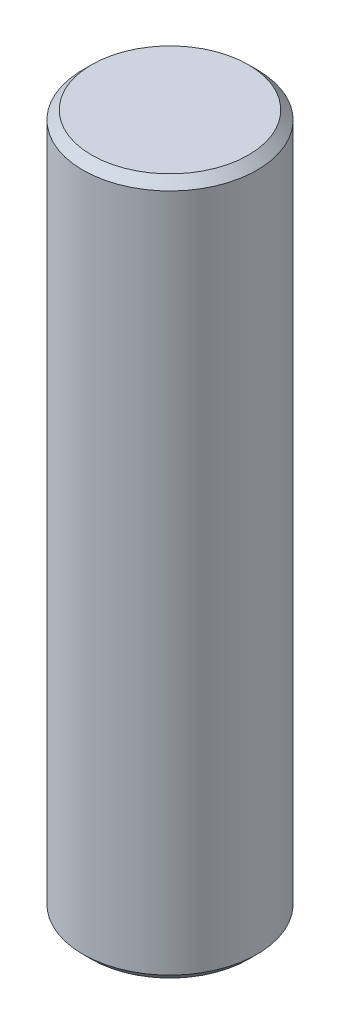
ISO-10303-21;
HEADER;
FILE_DESCRIPTION(('STEP AP214'),'2;1');
FILE_NAME('part.step','',(''),(''),'','','');
FILE_SCHEMA(('AUTOMOTIVE_DESIGN { 1 0 10303 214 1 1 1 1 }'));
ENDSEC;
DATA;
#1=APPLICATION_CONTEXT('core data for automotive mechanical design processes');
#2=APPLICATION_PROTOCOL_DEFINITION('international standard','automotive_design',2000,#1);
#3=PRODUCT_CONTEXT('',#1,'mechanical');
#4=PRODUCT('Part','Part','',(#3));
#5=PRODUCT_RELATED_PRODUCT_CATEGORY('part','',(#4));
#6=PRODUCT_DEFINITION_FORMATION('','',#4);
#7=PRODUCT_DEFINITION_CONTEXT('part definition',#1,'design');
#8=PRODUCT_DEFINITION('design','',#6,#7);
#9=PRODUCT_DEFINITION_SHAPE('','',#8);
#10=(LENGTH_UNIT() NAMED_UNIT(*) SI_UNIT(.MILLI.,.METRE.));
#11=(NAMED_UNIT(*) PLANE_ANGLE_UNIT() SI_UNIT($,.RADIAN.));
#12=(NAMED_UNIT(*) SI_UNIT($,.STERADIAN.) SOLID_ANGLE_UNIT());
#13=UNCERTAINTY_MEASURE_WITH_UNIT(LENGTH_MEASURE(1.E-05),#10,'distance_accuracy_value','');
#14=(GEOMETRIC_REPRESENTATION_CONTEXT(3) GLOBAL_UNCERTAINTY_ASSIGNED_CONTEXT((#13)) GLOBAL_UNIT_ASSIGNED_CONTEXT((#10,
#11,#12)) REPRESENTATION_CONTEXT('',''));
#15=CARTESIAN_POINT('',(0.,0.,0.));
#16=DIRECTION('',(0.,0.,1.));
#17=DIRECTION('',(1.,0.,0.));
#18=AXIS2_PLACEMENT_3D('',#15,#16,#17);
#19=CARTESIAN_POINT('',(0.,8.,0.));
#20=DIRECTION('',(0.,-1.,0.));
#21=DIRECTION('',(0.,0.,-1.));
#22=AXIS2_PLACEMENT_3D('',#19,#20,#21);
#23=CYLINDRICAL_SURFACE('',#22,1.);
#24=CARTESIAN_POINT('',(0.,0.0999999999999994,0.));
#25=DIRECTION('',(0.,1.,0.));
#26=DIRECTION('',(0.,0.,1.));
#27=AXIS2_PLACEMENT_3D('',#24,#25,#26);
#28=CIRCLE('',#27,1.);
#29=CARTESIAN_POINT('',(0.,0.0999999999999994,1.));
#30=VERTEX_POINT('',#29);
#31=EDGE_CURVE('E45',#30,#30,#28,.T.);
#32=ORIENTED_EDGE('',*,*,#31,.T.);
#33=EDGE_LOOP('',(#32));
#34=FACE_BOUND('',#33,.T.);
#35=CARTESIAN_POINT('',(0.,7.9,0.));
#36=DIRECTION('',(0.,1.,0.));
#37=DIRECTION('',(0.,0.,1.));
#38=AXIS2_PLACEMENT_3D('',#35,#36,#37);
#39=CIRCLE('',#38,1.);
#40=CARTESIAN_POINT('',(0.,7.9,1.));
#41=VERTEX_POINT('',#40);
#42=EDGE_CURVE('E49',#41,#41,#39,.F.);
#43=ORIENTED_EDGE('',*,*,#42,.T.);
#44=EDGE_LOOP('',(#43));
#45=FACE_BOUND('',#44,.T.);
#46=ADVANCED_FACE('F33',(#34,#45),#23,.T.);
#47=CARTESIAN_POINT('',(0.,8.,0.));
#48=DIRECTION('',(0.,1.,0.));
#49=DIRECTION('',(0.,0.,1.));
#50=AXIS2_PLACEMENT_3D('',#47,#48,#49);
#51=PLANE('',#50);
#52=CARTESIAN_POINT('',(0.,8.,0.));
#53=DIRECTION('',(0.,1.,0.));
#54=DIRECTION('',(0.,0.,1.));
#55=AXIS2_PLACEMENT_3D('',#52,#53,#54);
#56=CIRCLE('',#55,0.9);
#57=CARTESIAN_POINT('',(0.,8.,0.9));
#58=VERTEX_POINT('',#57);
#59=EDGE_CURVE('E10',#58,#58,#56,.T.);
#60=ORIENTED_EDGE('',*,*,#59,.T.);
#61=EDGE_LOOP('',(#60));
#62=FACE_BOUND('',#61,.T.);
#63=ADVANCED_FACE('F65',(#62),#51,.T.);
#64=CARTESIAN_POINT('',(0.,0.,0.));
#65=DIRECTION('',(0.,1.,0.));
#66=DIRECTION('',(0.,0.,1.));
#67=AXIS2_PLACEMENT_3D('',#64,#65,#66);
#68=PLANE('',#67);
#69=CARTESIAN_POINT('',(0.,0.,0.));
#70=DIRECTION('',(0.,1.,0.));
#71=DIRECTION('',(0.,0.,1.));
#72=AXIS2_PLACEMENT_3D('',#69,#70,#71);
#73=CIRCLE('',#72,0.900000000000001);
#74=CARTESIAN_POINT('',(0.,0.,0.900000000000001));
#75=VERTEX_POINT('',#74);
#76=EDGE_CURVE('E41',#75,#75,#73,.F.);
#77=ORIENTED_EDGE('',*,*,#76,.T.);
#78=EDGE_LOOP('',(#77));
#79=FACE_BOUND('',#78,.T.);
#80=ADVANCED_FACE('F62',(#79),#68,.F.);
#81=CARTESIAN_POINT('',(0.,0.0999999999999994,0.));
#82=DIRECTION('',(0.,1.,0.));
#83=DIRECTION('',(0.,0.,1.));
#84=AXIS2_PLACEMENT_3D('',#81,#82,#83);
#85=CONICAL_SURFACE('',#84,1.,0.785398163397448);
#86=ORIENTED_EDGE('',*,*,#76,.F.);
#87=EDGE_LOOP('',(#86));
#88=FACE_BOUND('',#87,.T.);
#89=ORIENTED_EDGE('',*,*,#31,.F.);
#90=EDGE_LOOP('',(#89));
#91=FACE_BOUND('',#90,.T.);
#92=ADVANCED_FACE('F58',(#88,#91),#85,.T.);
#93=CARTESIAN_POINT('',(0.,8.,0.));
#94=DIRECTION('',(0.,-1.,0.));
#95=DIRECTION('',(0.,0.,-1.));
#96=AXIS2_PLACEMENT_3D('',#93,#94,#95);
#97=CONICAL_SURFACE('',#96,0.9,0.785398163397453);
#98=ORIENTED_EDGE('',*,*,#42,.F.);
#99=EDGE_LOOP('',(#98));
#100=FACE_BOUND('',#99,.T.);
#101=ORIENTED_EDGE('',*,*,#59,.F.);
#102=EDGE_LOOP('',(#101));
#103=FACE_BOUND('',#102,.T.);
#104=ADVANCED_FACE('F36',(#100,#103),#97,.T.);
#105=CLOSED_SHELL('',(#46,#63,#80,#92,#104));
#106=MANIFOLD_SOLID_BREP('B2',#105);
#107=ADVANCED_BREP_SHAPE_REPRESENTATION('',(#18,#106),#14);
#108=SHAPE_DEFINITION_REPRESENTATION(#9,#107);
ENDSEC;
END-ISO-10303-21;
